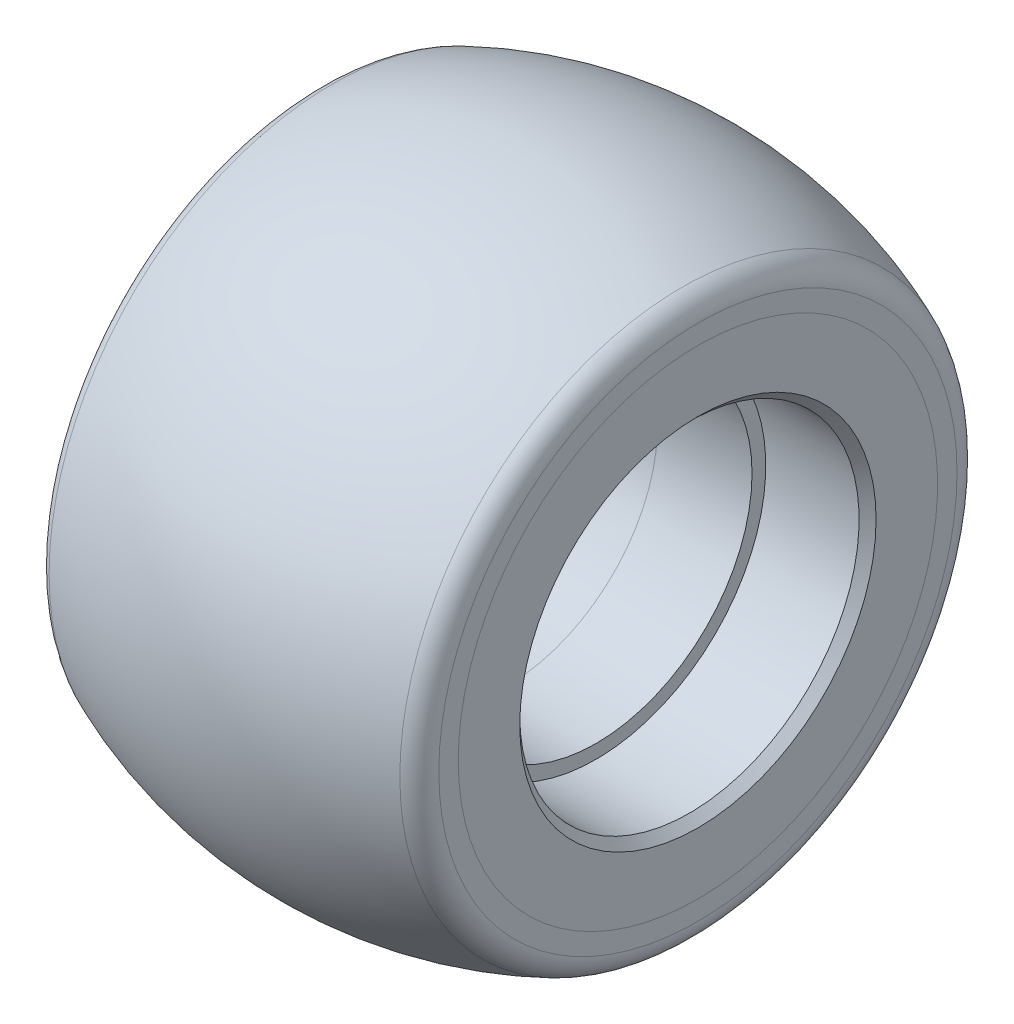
from build123d import *


with BuildPart() as part:
    # Sketch 1 → Revolve 1 (revolve)
    with BuildSketch(Plane(origin=(0, 0, 0), x_dir=(1, 0, 0), z_dir=(0, 1, 0)), mode=Mode.PRIVATE) as revolve_1_sk:
        Polygon((22.5, 28.25), (0, 29.5), (-22.5, 28.25), (-22.5, 21), (-21.5, 20), (-10.5, 20), (-10.5, 18.38), (0, 17.75), (10.5, 18.38), (10.5, 20), (21.5, 20), (22.5, 21), align=None)
    revolve(revolve_1_sk.sketch.rotate(Axis((-26.306215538, 0, 0), (1, 0, 0)), 180), axis=Axis((-26.306215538, 0, 0), (1, 0, 0)))


with BuildPart() as body_2:
    # Sketch 2 → Revolve 2 (revolve)
    with BuildSketch(Plane(origin=(0, 0, 0), x_dir=(1, 0, 0), z_dir=(0, 1, 0)), mode=Mode.PRIVATE) as revolve_2_sk:
        with BuildLine():
            Line((22.5, 28.25), (22.5, 30.540742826))
            ThreePointArc((22.5, 30.540742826), (22.0009998, 32.197546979), (20.67, 33.303187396))
            ThreePointArc((20.67, 33.303187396), (0, 37.5), (-20.67, 33.303187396))
            ThreePointArc((-20.67, 33.303187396), (-22.0009998, 32.197546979), (-22.5, 30.540742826))
            Line((-22.5, 30.540742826), (-22.5, 28.25))
            Line((-22.5, 28.25), (0, 29.5))
            Line((0, 29.5), (22.5, 28.25))
        make_face()
    revolve(revolve_2_sk.sketch.rotate(Axis((-26.306215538, 0, 0), (1, 0, 0)), 180), axis=Axis((-26.306215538, 0, 0), (1, 0, 0)))


solid = Compound([part.part, body_2.part])
